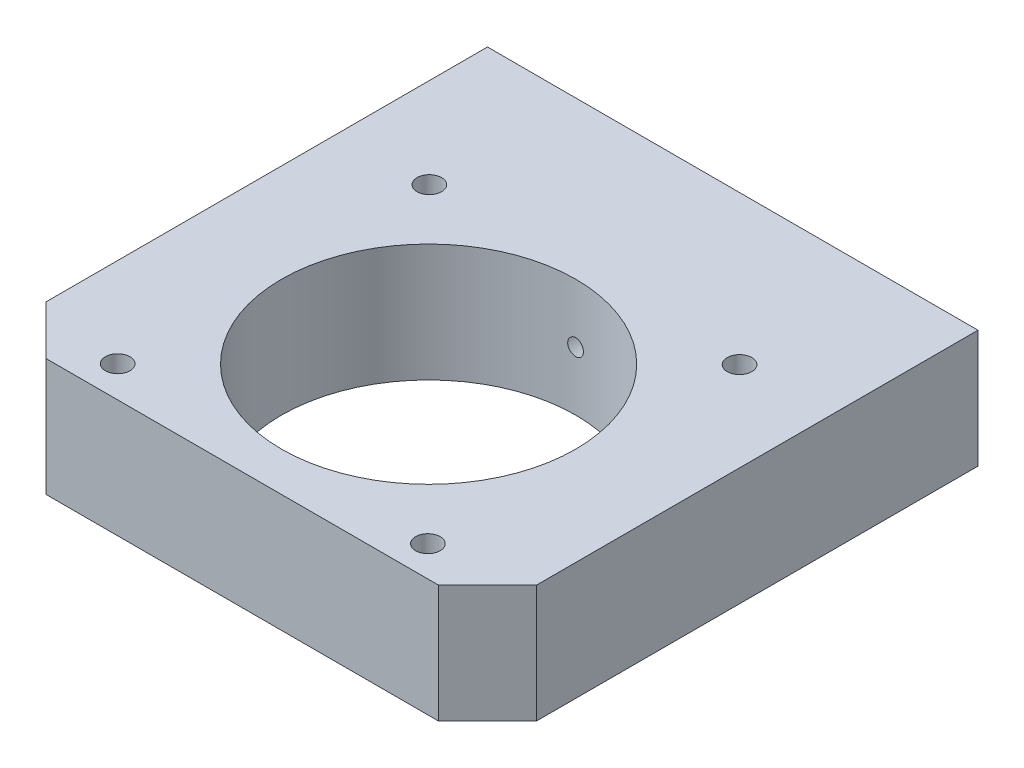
ISO-10303-21;
HEADER;
FILE_DESCRIPTION(('STEP AP214'),'2;1');
FILE_NAME('part.step','',(''),(''),'','','');
FILE_SCHEMA(('AUTOMOTIVE_DESIGN { 1 0 10303 214 1 1 1 1 }'));
ENDSEC;
DATA;
#1=APPLICATION_CONTEXT('core data for automotive mechanical design processes');
#2=APPLICATION_PROTOCOL_DEFINITION('international standard','automotive_design',2000,#1);
#3=PRODUCT_CONTEXT('',#1,'mechanical');
#4=PRODUCT('Part','Part','',(#3));
#5=PRODUCT_RELATED_PRODUCT_CATEGORY('part','',(#4));
#6=PRODUCT_DEFINITION_FORMATION('','',#4);
#7=PRODUCT_DEFINITION_CONTEXT('part definition',#1,'design');
#8=PRODUCT_DEFINITION('design','',#6,#7);
#9=PRODUCT_DEFINITION_SHAPE('','',#8);
#10=(LENGTH_UNIT() NAMED_UNIT(*) SI_UNIT(.MILLI.,.METRE.));
#11=(NAMED_UNIT(*) PLANE_ANGLE_UNIT() SI_UNIT($,.RADIAN.));
#12=(NAMED_UNIT(*) SI_UNIT($,.STERADIAN.) SOLID_ANGLE_UNIT());
#13=UNCERTAINTY_MEASURE_WITH_UNIT(LENGTH_MEASURE(1.E-05),#10,'distance_accuracy_value','');
#14=(GEOMETRIC_REPRESENTATION_CONTEXT(3) GLOBAL_UNCERTAINTY_ASSIGNED_CONTEXT((#13)) GLOBAL_UNIT_ASSIGNED_CONTEXT((#10,
#11,#12)) REPRESENTATION_CONTEXT('',''));
#15=CARTESIAN_POINT('',(0.,0.,0.));
#16=DIRECTION('',(0.,0.,1.));
#17=DIRECTION('',(1.,0.,0.));
#18=AXIS2_PLACEMENT_3D('',#15,#16,#17);
#19=CARTESIAN_POINT('',(26.923076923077,21.6923076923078,50.));
#20=DIRECTION('',(-1.,0.,0.));
#21=DIRECTION('',(0.,0.,1.));
#22=AXIS2_PLACEMENT_3D('',#19,#20,#21);
#23=PLANE('',#22);
#24=DIRECTION('',(0.,0.,-1.));
#25=VECTOR('',#24,1.);
#26=CARTESIAN_POINT('',(26.923076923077,33.6923076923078,50.));
#27=LINE('',#26,#25);
#28=CARTESIAN_POINT('',(26.923076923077,33.6923076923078,45.));
#29=VERTEX_POINT('',#28);
#30=CARTESIAN_POINT('',(26.923076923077,33.6923076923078,0.));
#31=VERTEX_POINT('',#30);
#32=EDGE_CURVE('E333',#29,#31,#27,.T.);
#33=ORIENTED_EDGE('',*,*,#32,.F.);
#34=DIRECTION('',(0.,-1.,0.));
#35=VECTOR('',#34,1.);
#36=CARTESIAN_POINT('',(26.923076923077,21.6923076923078,45.));
#37=LINE('',#36,#35);
#38=CARTESIAN_POINT('',(26.923076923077,21.6923076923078,45.));
#39=VERTEX_POINT('',#38);
#40=EDGE_CURVE('E221',#29,#39,#37,.T.);
#41=ORIENTED_EDGE('',*,*,#40,.T.);
#42=DIRECTION('',(0.,0.,-1.));
#43=VECTOR('',#42,1.);
#44=CARTESIAN_POINT('',(26.923076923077,21.6923076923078,50.));
#45=LINE('',#44,#43);
#46=CARTESIAN_POINT('',(26.923076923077,21.6923076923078,0.));
#47=VERTEX_POINT('',#46);
#48=EDGE_CURVE('E317',#39,#47,#45,.T.);
#49=ORIENTED_EDGE('',*,*,#48,.T.);
#50=DIRECTION('',(0.,1.,0.));
#51=VECTOR('',#50,1.);
#52=CARTESIAN_POINT('',(26.923076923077,21.6923076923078,0.));
#53=LINE('',#52,#51);
#54=EDGE_CURVE('E308',#47,#31,#53,.T.);
#55=ORIENTED_EDGE('',*,*,#54,.T.);
#56=EDGE_LOOP('',(#33,#41,#49,#55));
#57=FACE_BOUND('',#56,.T.);
#58=ADVANCED_FACE('F16',(#57),#23,.F.);
#59=CARTESIAN_POINT('',(26.923076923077,33.6923076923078,50.));
#60=DIRECTION('',(0.,-1.,0.));
#61=DIRECTION('',(0.,0.,-1.));
#62=AXIS2_PLACEMENT_3D('',#59,#60,#61);
#63=PLANE('',#62);
#64=CARTESIAN_POINT('',(-13.8868256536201,33.6923076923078,15.1151368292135));
#65=DIRECTION('',(0.,-1.,0.));
#66=DIRECTION('',(0.,0.,-1.));
#67=AXIS2_PLACEMENT_3D('',#64,#65,#66);
#68=CIRCLE('',#67,1.25);
#69=CARTESIAN_POINT('',(-13.8868256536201,33.6923076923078,13.8651368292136));
#70=VERTEX_POINT('',#69);
#71=EDGE_CURVE('E283',#70,#70,#68,.T.);
#72=ORIENTED_EDGE('',*,*,#71,.T.);
#73=EDGE_LOOP('',(#72));
#74=FACE_BOUND('',#73,.T.);
#75=CARTESIAN_POINT('',(-13.9617862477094,33.6923076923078,46.8099025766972));
#76=DIRECTION('',(0.,-1.,0.));
#77=DIRECTION('',(0.,0.,-1.));
#78=AXIS2_PLACEMENT_3D('',#75,#76,#77);
#79=CIRCLE('',#78,1.25);
#80=CARTESIAN_POINT('',(-13.9617862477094,33.6923076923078,45.5599025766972));
#81=VERTEX_POINT('',#80);
#82=EDGE_CURVE('E289',#81,#81,#79,.T.);
#83=ORIENTED_EDGE('',*,*,#82,.T.);
#84=EDGE_LOOP('',(#83));
#85=FACE_BOUND('',#84,.T.);
#86=CARTESIAN_POINT('',(17.8079400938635,33.6923076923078,15.1900974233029));
#87=DIRECTION('',(0.,-1.,0.));
#88=DIRECTION('',(0.,0.,-1.));
#89=AXIS2_PLACEMENT_3D('',#86,#87,#88);
#90=CIRCLE('',#89,1.25);
#91=CARTESIAN_POINT('',(17.8079400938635,33.6923076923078,13.9400974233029));
#92=VERTEX_POINT('',#91);
#93=EDGE_CURVE('E295',#92,#92,#90,.T.);
#94=ORIENTED_EDGE('',*,*,#93,.T.);
#95=EDGE_LOOP('',(#94));
#96=FACE_BOUND('',#95,.T.);
#97=CARTESIAN_POINT('',(17.7329794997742,33.6923076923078,46.8848631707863));
#98=DIRECTION('',(0.,-1.,0.));
#99=DIRECTION('',(0.,0.,-1.));
#100=AXIS2_PLACEMENT_3D('',#97,#98,#99);
#101=CIRCLE('',#100,1.25);
#102=CARTESIAN_POINT('',(17.7329794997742,33.6923076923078,45.6348631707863));
#103=VERTEX_POINT('',#102);
#104=EDGE_CURVE('E301',#103,#103,#101,.T.);
#105=ORIENTED_EDGE('',*,*,#104,.T.);
#106=EDGE_LOOP('',(#105));
#107=FACE_BOUND('',#106,.T.);
#108=CARTESIAN_POINT('',(1.923076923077,33.6923076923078,31.));
#109=DIRECTION('',(0.,-1.,0.));
#110=DIRECTION('',(0.,0.,-1.));
#111=AXIS2_PLACEMENT_3D('',#108,#109,#110);
#112=CIRCLE('',#111,15.);
#113=CARTESIAN_POINT('',(1.923076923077,33.6923076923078,16.));
#114=VERTEX_POINT('',#113);
#115=EDGE_CURVE('E305',#114,#114,#112,.T.);
#116=ORIENTED_EDGE('',*,*,#115,.T.);
#117=EDGE_LOOP('',(#116));
#118=FACE_BOUND('',#117,.T.);
#119=DIRECTION('',(-1.,0.,0.));
#120=VECTOR('',#119,1.);
#121=CARTESIAN_POINT('',(26.923076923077,33.6923076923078,50.));
#122=LINE('',#121,#120);
#123=CARTESIAN_POINT('',(21.923076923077,33.6923076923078,50.));
#124=VERTEX_POINT('',#123);
#125=CARTESIAN_POINT('',(-18.076923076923,33.6923076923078,50.));
#126=VERTEX_POINT('',#125);
#127=EDGE_CURVE('E311',#124,#126,#122,.T.);
#128=ORIENTED_EDGE('',*,*,#127,.F.);
#129=DIRECTION('',(0.707106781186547,0.,-0.707106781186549));
#130=VECTOR('',#129,1.);
#131=CARTESIAN_POINT('',(21.923076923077,33.6923076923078,50.));
#132=LINE('',#131,#130);
#133=EDGE_CURVE('E341',#124,#29,#132,.T.);
#134=ORIENTED_EDGE('',*,*,#133,.T.);
#135=ORIENTED_EDGE('',*,*,#32,.T.);
#136=DIRECTION('',(-1.,0.,0.));
#137=VECTOR('',#136,1.);
#138=CARTESIAN_POINT('',(26.923076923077,33.6923076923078,0.));
#139=LINE('',#138,#137);
#140=CARTESIAN_POINT('',(-23.076923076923,33.6923076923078,0.));
#141=VERTEX_POINT('',#140);
#142=EDGE_CURVE('E320',#31,#141,#139,.T.);
#143=ORIENTED_EDGE('',*,*,#142,.T.);
#144=DIRECTION('',(0.,0.,-1.));
#145=VECTOR('',#144,1.);
#146=CARTESIAN_POINT('',(-23.076923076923,33.6923076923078,50.));
#147=LINE('',#146,#145);
#148=CARTESIAN_POINT('',(-23.076923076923,33.6923076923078,45.));
#149=VERTEX_POINT('',#148);
#150=EDGE_CURVE('E331',#149,#141,#147,.T.);
#151=ORIENTED_EDGE('',*,*,#150,.F.);
#152=DIRECTION('',(0.707106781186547,0.,0.707106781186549));
#153=VECTOR('',#152,1.);
#154=CARTESIAN_POINT('',(-18.076923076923,33.6923076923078,50.));
#155=LINE('',#154,#153);
#156=EDGE_CURVE('E339',#149,#126,#155,.T.);
#157=ORIENTED_EDGE('',*,*,#156,.T.);
#158=EDGE_LOOP('',(#128,#134,#135,#143,#151,#157));
#159=FACE_BOUND('',#158,.T.);
#160=ADVANCED_FACE('F198',(#74,#85,#96,#107,#118,#159),#63,.F.);
#161=CARTESIAN_POINT('',(-23.076923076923,21.6923076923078,50.));
#162=DIRECTION('',(1.,0.,0.));
#163=DIRECTION('',(0.,0.,-1.));
#164=AXIS2_PLACEMENT_3D('',#161,#162,#163);
#165=PLANE('',#164);
#166=DIRECTION('',(0.,0.,-1.));
#167=VECTOR('',#166,1.);
#168=CARTESIAN_POINT('',(-23.076923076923,21.6923076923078,50.));
#169=LINE('',#168,#167);
#170=CARTESIAN_POINT('',(-23.076923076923,21.6923076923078,45.));
#171=VERTEX_POINT('',#170);
#172=CARTESIAN_POINT('',(-23.076923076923,21.6923076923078,0.));
#173=VERTEX_POINT('',#172);
#174=EDGE_CURVE('E329',#171,#173,#169,.T.);
#175=ORIENTED_EDGE('',*,*,#174,.F.);
#176=DIRECTION('',(0.,1.,0.));
#177=VECTOR('',#176,1.);
#178=CARTESIAN_POINT('',(-23.076923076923,33.6923076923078,45.));
#179=LINE('',#178,#177);
#180=EDGE_CURVE('E228',#171,#149,#179,.T.);
#181=ORIENTED_EDGE('',*,*,#180,.T.);
#182=ORIENTED_EDGE('',*,*,#150,.T.);
#183=DIRECTION('',(0.,-1.,0.));
#184=VECTOR('',#183,1.);
#185=CARTESIAN_POINT('',(-23.076923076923,21.6923076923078,0.));
#186=LINE('',#185,#184);
#187=EDGE_CURVE('E323',#141,#173,#186,.T.);
#188=ORIENTED_EDGE('',*,*,#187,.T.);
#189=EDGE_LOOP('',(#175,#181,#182,#188));
#190=FACE_BOUND('',#189,.T.);
#191=ADVANCED_FACE('F194',(#190),#165,.F.);
#192=CARTESIAN_POINT('',(26.923076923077,21.6923076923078,50.));
#193=DIRECTION('',(0.,1.,0.));
#194=DIRECTION('',(-1.,0.,0.));
#195=AXIS2_PLACEMENT_3D('',#192,#193,#194);
#196=PLANE('',#195);
#197=CARTESIAN_POINT('',(-13.8868256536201,21.6923076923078,15.1151368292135));
#198=DIRECTION('',(0.,-1.,0.));
#199=DIRECTION('',(0.,0.,-1.));
#200=AXIS2_PLACEMENT_3D('',#197,#198,#199);
#201=CIRCLE('',#200,1.25);
#202=CARTESIAN_POINT('',(-13.8868256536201,21.6923076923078,13.8651368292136));
#203=VERTEX_POINT('',#202);
#204=EDGE_CURVE('E267',#203,#203,#201,.T.);
#205=ORIENTED_EDGE('',*,*,#204,.F.);
#206=EDGE_LOOP('',(#205));
#207=FACE_BOUND('',#206,.T.);
#208=CARTESIAN_POINT('',(-13.9617862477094,21.6923076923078,46.8099025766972));
#209=DIRECTION('',(0.,-1.,0.));
#210=DIRECTION('',(0.,0.,-1.));
#211=AXIS2_PLACEMENT_3D('',#208,#209,#210);
#212=CIRCLE('',#211,1.25);
#213=CARTESIAN_POINT('',(-13.9617862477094,21.6923076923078,45.5599025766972));
#214=VERTEX_POINT('',#213);
#215=EDGE_CURVE('E286',#214,#214,#212,.T.);
#216=ORIENTED_EDGE('',*,*,#215,.F.);
#217=EDGE_LOOP('',(#216));
#218=FACE_BOUND('',#217,.T.);
#219=CARTESIAN_POINT('',(17.8079400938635,21.6923076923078,15.1900974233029));
#220=DIRECTION('',(0.,-1.,0.));
#221=DIRECTION('',(0.,0.,-1.));
#222=AXIS2_PLACEMENT_3D('',#219,#220,#221);
#223=CIRCLE('',#222,1.25);
#224=CARTESIAN_POINT('',(17.8079400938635,21.6923076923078,13.9400974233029));
#225=VERTEX_POINT('',#224);
#226=EDGE_CURVE('E292',#225,#225,#223,.T.);
#227=ORIENTED_EDGE('',*,*,#226,.F.);
#228=EDGE_LOOP('',(#227));
#229=FACE_BOUND('',#228,.T.);
#230=CARTESIAN_POINT('',(17.7329794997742,21.6923076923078,46.8848631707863));
#231=DIRECTION('',(0.,-1.,0.));
#232=DIRECTION('',(0.,0.,-1.));
#233=AXIS2_PLACEMENT_3D('',#230,#231,#232);
#234=CIRCLE('',#233,1.25);
#235=CARTESIAN_POINT('',(17.7329794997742,21.6923076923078,45.6348631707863));
#236=VERTEX_POINT('',#235);
#237=EDGE_CURVE('E298',#236,#236,#234,.T.);
#238=ORIENTED_EDGE('',*,*,#237,.F.);
#239=EDGE_LOOP('',(#238));
#240=FACE_BOUND('',#239,.T.);
#241=CARTESIAN_POINT('',(1.923076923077,21.6923076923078,31.));
#242=DIRECTION('',(0.,-1.,0.));
#243=DIRECTION('',(0.,0.,-1.));
#244=AXIS2_PLACEMENT_3D('',#241,#242,#243);
#245=CIRCLE('',#244,15.);
#246=CARTESIAN_POINT('',(1.923076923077,21.6923076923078,16.));
#247=VERTEX_POINT('',#246);
#248=EDGE_CURVE('E304',#247,#247,#245,.T.);
#249=ORIENTED_EDGE('',*,*,#248,.F.);
#250=EDGE_LOOP('',(#249));
#251=FACE_BOUND('',#250,.T.);
#252=ORIENTED_EDGE('',*,*,#48,.F.);
#253=DIRECTION('',(-0.707106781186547,0.,0.707106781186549));
#254=VECTOR('',#253,1.);
#255=CARTESIAN_POINT('',(21.923076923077,21.6923076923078,50.));
#256=LINE('',#255,#254);
#257=CARTESIAN_POINT('',(21.923076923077,21.6923076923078,50.));
#258=VERTEX_POINT('',#257);
#259=EDGE_CURVE('E220',#39,#258,#256,.T.);
#260=ORIENTED_EDGE('',*,*,#259,.T.);
#261=DIRECTION('',(1.,0.,0.));
#262=VECTOR('',#261,1.);
#263=CARTESIAN_POINT('',(26.923076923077,21.6923076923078,50.));
#264=LINE('',#263,#262);
#265=CARTESIAN_POINT('',(-18.076923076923,21.6923076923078,50.));
#266=VERTEX_POINT('',#265);
#267=EDGE_CURVE('E314',#266,#258,#264,.T.);
#268=ORIENTED_EDGE('',*,*,#267,.F.);
#269=DIRECTION('',(-0.707106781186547,0.,-0.707106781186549));
#270=VECTOR('',#269,1.);
#271=CARTESIAN_POINT('',(-18.076923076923,21.6923076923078,50.));
#272=LINE('',#271,#270);
#273=EDGE_CURVE('E229',#266,#171,#272,.T.);
#274=ORIENTED_EDGE('',*,*,#273,.T.);
#275=ORIENTED_EDGE('',*,*,#174,.T.);
#276=DIRECTION('',(1.,0.,0.));
#277=VECTOR('',#276,1.);
#278=CARTESIAN_POINT('',(26.923076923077,21.6923076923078,0.));
#279=LINE('',#278,#277);
#280=EDGE_CURVE('E315',#173,#47,#279,.T.);
#281=ORIENTED_EDGE('',*,*,#280,.T.);
#282=EDGE_LOOP('',(#252,#260,#268,#274,#275,#281));
#283=FACE_BOUND('',#282,.T.);
#284=ADVANCED_FACE('F187',(#207,#218,#229,#240,#251,#283),#196,.F.);
#285=CARTESIAN_POINT('',(0.,0.,50.));
#286=DIRECTION('',(0.,0.,1.));
#287=DIRECTION('',(1.,0.,0.));
#288=AXIS2_PLACEMENT_3D('',#285,#286,#287);
#289=PLANE('',#288);
#290=ORIENTED_EDGE('',*,*,#267,.T.);
#291=DIRECTION('',(0.,1.,0.));
#292=VECTOR('',#291,1.);
#293=CARTESIAN_POINT('',(21.923076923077,33.6923076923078,50.));
#294=LINE('',#293,#292);
#295=EDGE_CURVE('E223',#258,#124,#294,.T.);
#296=ORIENTED_EDGE('',*,*,#295,.T.);
#297=ORIENTED_EDGE('',*,*,#127,.T.);
#298=DIRECTION('',(0.,-1.,0.));
#299=VECTOR('',#298,1.);
#300=CARTESIAN_POINT('',(-18.076923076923,21.6923076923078,50.));
#301=LINE('',#300,#299);
#302=EDGE_CURVE('E335',#126,#266,#301,.T.);
#303=ORIENTED_EDGE('',*,*,#302,.T.);
#304=EDGE_LOOP('',(#290,#296,#297,#303));
#305=FACE_BOUND('',#304,.T.);
#306=ADVANCED_FACE('F184',(#305),#289,.T.);
#307=CARTESIAN_POINT('',(0.,0.,0.));
#308=DIRECTION('',(0.,0.,1.));
#309=DIRECTION('',(1.,0.,0.));
#310=AXIS2_PLACEMENT_3D('',#307,#308,#309);
#311=PLANE('',#310);
#312=CARTESIAN_POINT('',(-13.0769230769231,27.6923076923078,0.));
#313=DIRECTION('',(0.,0.,-1.));
#314=DIRECTION('',(-1.,0.,0.));
#315=AXIS2_PLACEMENT_3D('',#312,#313,#314);
#316=CIRCLE('',#315,2.5);
#317=CARTESIAN_POINT('',(-15.5769230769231,27.6923076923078,0.));
#318=VERTEX_POINT('',#317);
#319=EDGE_CURVE('E561',#318,#318,#316,.T.);
#320=ORIENTED_EDGE('',*,*,#319,.F.);
#321=EDGE_LOOP('',(#320));
#322=FACE_BOUND('',#321,.T.);
#323=CARTESIAN_POINT('',(1.92307692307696,27.6923076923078,0.));
#324=DIRECTION('',(0.,0.,-1.));
#325=DIRECTION('',(-1.,0.,0.));
#326=AXIS2_PLACEMENT_3D('',#323,#324,#325);
#327=CIRCLE('',#326,2.5);
#328=CARTESIAN_POINT('',(-0.576923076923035,27.6923076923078,0.));
#329=VERTEX_POINT('',#328);
#330=EDGE_CURVE('E113',#329,#329,#327,.T.);
#331=ORIENTED_EDGE('',*,*,#330,.F.);
#332=EDGE_LOOP('',(#331));
#333=FACE_BOUND('',#332,.T.);
#334=CARTESIAN_POINT('',(16.9230769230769,27.6923076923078,0.));
#335=DIRECTION('',(0.,0.,-1.));
#336=DIRECTION('',(-1.,0.,0.));
#337=AXIS2_PLACEMENT_3D('',#334,#335,#336);
#338=CIRCLE('',#337,2.5);
#339=CARTESIAN_POINT('',(14.4230769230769,27.6923076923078,0.));
#340=VERTEX_POINT('',#339);
#341=EDGE_CURVE('E168',#340,#340,#338,.T.);
#342=ORIENTED_EDGE('',*,*,#341,.F.);
#343=EDGE_LOOP('',(#342));
#344=FACE_BOUND('',#343,.T.);
#345=ORIENTED_EDGE('',*,*,#54,.F.);
#346=ORIENTED_EDGE('',*,*,#280,.F.);
#347=ORIENTED_EDGE('',*,*,#187,.F.);
#348=ORIENTED_EDGE('',*,*,#142,.F.);
#349=EDGE_LOOP('',(#345,#346,#347,#348));
#350=FACE_BOUND('',#349,.T.);
#351=ADVANCED_FACE('F182',(#322,#333,#344,#350),#311,.F.);
#352=CARTESIAN_POINT('',(1.923076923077,33.6923076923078,31.));
#353=DIRECTION('',(0.,-1.,0.));
#354=DIRECTION('',(0.,0.,-1.));
#355=AXIS2_PLACEMENT_3D('',#352,#353,#354);
#356=CYLINDRICAL_SURFACE('',#355,15.);
#357=CARTESIAN_POINT('',(1.23497310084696,27.2660384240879,16.0157912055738));
#358=CARTESIAN_POINT('',(1.211246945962,27.307785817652,16.0168806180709));
#359=CARTESIAN_POINT('',(1.19106479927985,27.3515959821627,16.0178631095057));
#360=CARTESIAN_POINT('',(1.15828292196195,27.4420197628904,16.0195006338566));
#361=CARTESIAN_POINT('',(1.14569498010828,27.4886376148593,16.0201551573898));
#362=CARTESIAN_POINT('',(1.12839188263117,27.5833931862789,16.021063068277));
#363=CARTESIAN_POINT('',(1.12368883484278,27.631533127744,16.0213158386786));
#364=CARTESIAN_POINT('',(1.12229669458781,27.7279131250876,16.0213902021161));
#365=CARTESIAN_POINT('',(1.12560536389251,27.7761531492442,16.0212119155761));
#366=CARTESIAN_POINT('',(1.14026703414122,27.8721088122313,16.0204384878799));
#367=CARTESIAN_POINT('',(1.15173526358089,27.919806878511,16.0198373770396));
#368=CARTESIAN_POINT('',(1.18259021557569,28.0125727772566,16.0182805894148));
#369=CARTESIAN_POINT('',(1.20197748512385,28.0576404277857,16.0173248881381));
#370=CARTESIAN_POINT('',(1.24797811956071,28.1433203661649,16.0151822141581));
#371=CARTESIAN_POINT('',(1.27451429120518,28.1839740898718,16.0139977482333));
#372=CARTESIAN_POINT('',(1.3342500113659,28.2600529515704,16.0115319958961));
#373=CARTESIAN_POINT('',(1.3674484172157,28.2954789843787,16.0102507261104));
#374=CARTESIAN_POINT('',(1.43843639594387,28.358816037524,16.0077906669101));
#375=CARTESIAN_POINT('',(1.47604013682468,28.3869350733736,16.006609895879));
#376=CARTESIAN_POINT('',(1.55561324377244,28.4361228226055,16.0044489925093));
#377=CARTESIAN_POINT('',(1.59758135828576,28.457193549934,16.0034688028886));
#378=CARTESIAN_POINT('',(1.68272512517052,28.4907271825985,16.0018679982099));
#379=CARTESIAN_POINT('',(1.72576882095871,28.5035246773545,16.0012335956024));
#380=CARTESIAN_POINT('',(1.81342727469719,28.5214448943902,16.0003368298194));
#381=CARTESIAN_POINT('',(1.85804167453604,28.5265693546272,16.000074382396));
#382=CARTESIAN_POINT('',(1.9460094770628,28.5289082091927,15.9999551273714));
#383=CARTESIAN_POINT('',(1.98935632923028,28.5263761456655,16.0000853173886));
#384=CARTESIAN_POINT('',(2.07499731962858,28.5140444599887,16.0007082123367));
#385=CARTESIAN_POINT('',(2.1172915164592,28.5042452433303,16.0012008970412));
#386=CARTESIAN_POINT('',(2.19947823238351,28.4777854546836,16.002490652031));
#387=CARTESIAN_POINT('',(2.2393796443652,28.4611523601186,16.003286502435));
#388=CARTESIAN_POINT('',(2.31591900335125,28.4215908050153,16.0050961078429));
#389=CARTESIAN_POINT('',(2.35255662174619,28.3986617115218,16.0061098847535));
#390=CARTESIAN_POINT('',(2.42256872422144,28.3465645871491,16.0082766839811));
#391=CARTESIAN_POINT('',(2.45583444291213,28.3172506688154,16.0094326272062));
#392=CARTESIAN_POINT('',(2.51721176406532,28.2536525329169,16.0117396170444));
#393=CARTESIAN_POINT('',(2.54532240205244,28.2193673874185,16.012890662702));
#394=CARTESIAN_POINT('',(2.59682444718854,28.1452888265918,16.0151156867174));
#395=CARTESIAN_POINT('',(2.61997295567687,28.1053263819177,16.0161845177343));
#396=CARTESIAN_POINT('',(2.65952020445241,28.0221862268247,16.0180760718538));
#397=CARTESIAN_POINT('',(2.67591762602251,27.979007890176,16.0188987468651));
#398=CARTESIAN_POINT('',(2.70211392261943,27.8889051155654,16.0202375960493));
#399=CARTESIAN_POINT('',(2.71163880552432,27.8419007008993,16.0207409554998));
#400=CARTESIAN_POINT('',(2.72285084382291,27.7469618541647,16.0213353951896));
#401=CARTESIAN_POINT('',(2.72453690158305,27.6990272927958,16.0214264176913));
#402=CARTESIAN_POINT('',(2.71998697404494,27.6025353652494,16.0211836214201));
#403=CARTESIAN_POINT('',(2.71358600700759,27.5539856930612,16.02084095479));
#404=CARTESIAN_POINT('',(2.69271582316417,27.4586522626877,16.0197542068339));
#405=CARTESIAN_POINT('',(2.6782462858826,27.4118685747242,16.0190101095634));
#406=CARTESIAN_POINT('',(2.64161323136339,27.3215648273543,16.0172085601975));
#407=CARTESIAN_POINT('',(2.61947067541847,27.2780362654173,16.0161519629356));
#408=CARTESIAN_POINT('',(2.56800572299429,27.1954518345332,16.0138488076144));
#409=CARTESIAN_POINT('',(2.53868413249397,27.1563954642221,16.0126022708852));
#410=CARTESIAN_POINT('',(2.47447366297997,27.0850151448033,16.0101046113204));
#411=CARTESIAN_POINT('',(2.43975243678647,27.0525405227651,16.0088544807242));
#412=CARTESIAN_POINT('',(2.36514063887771,26.9941914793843,16.0064691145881));
#413=CARTESIAN_POINT('',(2.32525141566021,26.9683153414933,16.0053338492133));
#414=CARTESIAN_POINT('',(2.24323779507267,26.9250681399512,16.0033634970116));
#415=CARTESIAN_POINT('',(2.2012784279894,26.9073846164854,16.0025177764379));
#416=CARTESIAN_POINT('',(2.11490926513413,26.8796282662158,16.00116464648));
#417=CARTESIAN_POINT('',(2.07050011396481,26.8695534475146,16.0006571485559));
#418=CARTESIAN_POINT('',(1.98233565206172,26.8576418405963,16.000054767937));
#419=CARTESIAN_POINT('',(1.9386211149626,26.8555024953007,15.9999447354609));
#420=CARTESIAN_POINT('',(1.85147191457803,26.8586994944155,16.0001076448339));
#421=CARTESIAN_POINT('',(1.80803720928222,26.8640346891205,16.0003805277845));
#422=CARTESIAN_POINT('',(1.7233092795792,26.8818525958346,16.0012712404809));
#423=CARTESIAN_POINT('',(1.68199451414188,26.8942336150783,16.0018841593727));
#424=CARTESIAN_POINT('',(1.6019683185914,26.9256376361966,16.0033839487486));
#425=CARTESIAN_POINT('',(1.56325768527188,26.9446626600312,16.0042709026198));
#426=CARTESIAN_POINT('',(1.48877578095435,26.9891220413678,16.0062413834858));
#427=CARTESIAN_POINT('',(1.453069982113,27.0146656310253,16.0073281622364));
#428=CARTESIAN_POINT('',(1.38628643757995,27.0711622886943,16.0095706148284));
#429=CARTESIAN_POINT('',(1.35520414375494,27.1021099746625,16.0107262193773));
#430=CARTESIAN_POINT('',(1.3094271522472,27.155551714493,16.0125473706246));
#431=CARTESIAN_POINT('',(1.29306503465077,27.1766432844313,16.0132284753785));
#432=CARTESIAN_POINT('',(1.26242841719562,27.2202905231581,16.0145477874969));
#433=CARTESIAN_POINT('',(1.24815387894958,27.2428461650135,16.0151859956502));
#434=CARTESIAN_POINT('',(1.23497310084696,27.2660384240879,16.0157912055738));
#435=B_SPLINE_CURVE_WITH_KNOTS('',3,(#357,#358,#359,#360,#361,#362,#363,#364,#365,#366,#367,
#368,#369,#370,#371,#372,#373,#374,#375,#376,#377,#378,#379,#380,#381,#382,#383,#384,#385,#386,
#387,#388,#389,#390,#391,#392,#393,#394,#395,#396,#397,#398,#399,#400,#401,#402,#403,#404,#405,
#406,#407,#408,#409,#410,#411,#412,#413,#414,#415,#416,#417,#418,#419,#420,#421,#422,#423,#424,
#425,#426,#427,#428,#429,#430,#431,#432,#433,#434),.UNSPECIFIED.,.T.,.F.,(4,2,2,2,2,2,2,2,2,2,2,
2,2,2,2,2,2,2,2,2,2,2,2,2,2,2,2,2,2,2,2,2,2,2,2,2,2,2,4),(0.,0.143994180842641,
0.288211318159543,0.432649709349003,0.577047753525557,0.723526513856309,0.87001539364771,
1.01498184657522,1.1599234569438,1.30012114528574,1.44027873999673,1.57433906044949,
1.70836901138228,1.83800976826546,1.96764329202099,2.09676061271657,2.22589091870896,
2.35835752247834,2.49084888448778,2.62881301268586,2.76680407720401,2.91003122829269,
3.05327843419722,3.1994957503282,3.34571887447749,3.49154565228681,3.63735606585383,
3.77931215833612,3.9212312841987,4.05716979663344,4.1930727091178,4.32373741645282,
4.45438202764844,4.58318719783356,4.7120316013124,4.84319584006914,4.97423018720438,
5.05422588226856,5.13422010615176),.UNSPECIFIED.);
#436=CARTESIAN_POINT('',(1.23497310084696,27.2660384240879,16.0157912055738));
#437=VERTEX_POINT('',#436);
#438=EDGE_CURVE('E161',#437,#437,#435,.T.);
#439=ORIENTED_EDGE('',*,*,#438,.T.);
#440=EDGE_LOOP('',(#439));
#441=FACE_BOUND('',#440,.T.);
#442=ORIENTED_EDGE('',*,*,#115,.F.);
#443=EDGE_LOOP('',(#442));
#444=FACE_BOUND('',#443,.T.);
#445=ORIENTED_EDGE('',*,*,#248,.T.);
#446=EDGE_LOOP('',(#445));
#447=FACE_BOUND('',#446,.T.);
#448=ADVANCED_FACE('F176',(#441,#444,#447),#356,.F.);
#449=CARTESIAN_POINT('',(17.7329794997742,21.6923076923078,46.8848631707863));
#450=DIRECTION('',(0.,-1.,0.));
#451=DIRECTION('',(0.,0.,-1.));
#452=AXIS2_PLACEMENT_3D('',#449,#450,#451);
#453=CYLINDRICAL_SURFACE('',#452,1.25);
#454=ORIENTED_EDGE('',*,*,#104,.F.);
#455=EDGE_LOOP('',(#454));
#456=FACE_BOUND('',#455,.T.);
#457=ORIENTED_EDGE('',*,*,#237,.T.);
#458=EDGE_LOOP('',(#457));
#459=FACE_BOUND('',#458,.T.);
#460=ADVANCED_FACE('F181',(#456,#459),#453,.F.);
#461=CARTESIAN_POINT('',(17.8079400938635,21.6923076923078,15.1900974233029));
#462=DIRECTION('',(0.,-1.,0.));
#463=DIRECTION('',(0.,0.,-1.));
#464=AXIS2_PLACEMENT_3D('',#461,#462,#463);
#465=CYLINDRICAL_SURFACE('',#464,1.25);
#466=CARTESIAN_POINT('',(16.5724794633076,30.1676019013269,15.));
#467=CARTESIAN_POINT('',(16.5778242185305,30.1683548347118,14.9652650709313));
#468=CARTESIAN_POINT('',(16.5846309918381,30.1693057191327,14.930777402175));
#469=CARTESIAN_POINT('',(16.6011177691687,30.1715042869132,14.8625092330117));
#470=CARTESIAN_POINT('',(16.6107974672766,30.1727519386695,14.8287286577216));
#471=CARTESIAN_POINT('',(16.6440501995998,30.1767891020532,14.7288207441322));
#472=CARTESIAN_POINT('',(16.6718475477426,30.1798746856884,14.6640583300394));
#473=CARTESIAN_POINT('',(16.7379164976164,30.1856606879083,14.5401043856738));
#474=CARTESIAN_POINT('',(16.7761923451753,30.1883609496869,14.4809151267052));
#475=CARTESIAN_POINT('',(16.8621673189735,30.1919347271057,14.3697658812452));
#476=CARTESIAN_POINT('',(16.9098632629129,30.1928088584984,14.3178034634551));
#477=CARTESIAN_POINT('',(17.0127889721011,30.1912213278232,14.2231035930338));
#478=CARTESIAN_POINT('',(17.0679412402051,30.188791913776,14.180281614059));
#479=CARTESIAN_POINT('',(17.1843196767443,30.1793038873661,14.1045510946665));
#480=CARTESIAN_POINT('',(17.245543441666,30.172247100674,14.0716386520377));
#481=CARTESIAN_POINT('',(17.3684613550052,30.1530581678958,14.0180848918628));
#482=CARTESIAN_POINT('',(17.4299578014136,30.1412155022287,13.996884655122));
#483=CARTESIAN_POINT('',(17.5542691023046,30.112156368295,13.9644232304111));
#484=CARTESIAN_POINT('',(17.6170837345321,30.0949407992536,13.9531603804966));
#485=CARTESIAN_POINT('',(17.7410371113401,30.0555907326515,13.9403577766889));
#486=CARTESIAN_POINT('',(17.8021867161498,30.0335371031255,13.9386691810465));
#487=CARTESIAN_POINT('',(17.9222572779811,29.9848700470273,13.9438839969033));
#488=CARTESIAN_POINT('',(17.9811770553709,29.9582542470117,13.9507918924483));
#489=CARTESIAN_POINT('',(18.1010973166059,29.8984749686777,13.9732865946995));
#490=CARTESIAN_POINT('',(18.1617612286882,29.8649292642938,13.9896375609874));
#491=CARTESIAN_POINT('',(18.2781051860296,29.7943387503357,14.0302508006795));
#492=CARTESIAN_POINT('',(18.3337867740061,29.757295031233,14.0545106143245));
#493=CARTESIAN_POINT('',(18.4497668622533,29.6735326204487,14.1151035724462));
#494=CARTESIAN_POINT('',(18.5089564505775,29.6263066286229,14.1528506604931));
#495=CARTESIAN_POINT('',(18.6196783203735,29.5299554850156,14.2369739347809));
#496=CARTESIAN_POINT('',(18.6711743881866,29.4808226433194,14.2833887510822));
#497=CARTESIAN_POINT('',(18.7471574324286,29.4024022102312,14.3641989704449));
#498=CARTESIAN_POINT('',(18.7742525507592,29.3729773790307,14.3960538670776));
#499=CARTESIAN_POINT('',(18.8254212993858,29.3148315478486,14.4627722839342));
#500=CARTESIAN_POINT('',(18.8494928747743,29.2861110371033,14.4976378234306));
#501=CARTESIAN_POINT('',(18.8942246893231,29.2304362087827,14.5701896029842));
#502=CARTESIAN_POINT('',(18.9149142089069,29.2034681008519,14.6078470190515));
#503=CARTESIAN_POINT('',(18.9528318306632,29.1521397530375,14.6864840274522));
#504=CARTESIAN_POINT('',(18.9700651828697,29.1277755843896,14.7274584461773));
#505=CARTESIAN_POINT('',(18.998032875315,29.0869628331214,14.8059008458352));
#506=CARTESIAN_POINT('',(19.009372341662,29.0698719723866,14.8428059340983));
#507=CARTESIAN_POINT('',(19.0289198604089,29.0398078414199,14.9193920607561));
#508=CARTESIAN_POINT('',(19.0371007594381,29.0268704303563,14.9590938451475));
#509=CARTESIAN_POINT('',(19.0434007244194,29.0167800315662,15.));
#510=B_SPLINE_CURVE_WITH_KNOTS('',3,(#466,#467,#468,#469,#470,#471,#472,#473,#474,#475,#476,
#477,#478,#479,#480,#481,#482,#483,#484,#485,#486,#487,#488,#489,#490,#491,#492,#493,#494,#495,
#496,#497,#498,#499,#500,#501,#502,#503,#504,#505,#506,#507,#508,#509),.UNSPECIFIED.,.F.,.F.,(4,
2,2,2,2,2,2,2,2,2,2,2,2,2,2,2,2,2,2,2,2,4),(0.,0.105388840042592,0.210766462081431,
0.421315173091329,0.631949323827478,0.842512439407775,1.05103480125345,1.25947494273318,
1.45684399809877,1.65418003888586,1.84843969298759,2.04280071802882,2.25567900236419,
2.46849114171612,2.72142756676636,2.97551940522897,3.1287693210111,3.28212283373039,
3.43406892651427,3.58578243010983,3.71207453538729,3.83942937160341),.UNSPECIFIED.);
#511=CARTESIAN_POINT('',(16.5724794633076,30.1676019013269,15.));
#512=VERTEX_POINT('',#511);
#513=CARTESIAN_POINT('',(19.0434007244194,29.0167800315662,15.));
#514=VERTEX_POINT('',#513);
#515=EDGE_CURVE('E272',#512,#514,#510,.T.);
#516=ORIENTED_EDGE('',*,*,#515,.T.);
#517=CARTESIAN_POINT('',(19.0124062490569,29.4649701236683,14.8557902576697));
#518=CARTESIAN_POINT('',(19.0187234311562,29.3989978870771,14.8785319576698));
#519=CARTESIAN_POINT('',(19.0242044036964,29.3327809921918,14.9007969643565));
#520=CARTESIAN_POINT('',(19.0336876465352,29.1998182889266,14.9440680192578));
#521=CARTESIAN_POINT('',(19.0376896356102,29.133072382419,14.9650738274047));
#522=CARTESIAN_POINT('',(19.0444260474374,28.9986445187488,15.0056304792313));
#523=CARTESIAN_POINT('',(19.047152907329,28.9309593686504,15.0251720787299));
#524=CARTESIAN_POINT('',(19.0515267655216,28.7950214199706,15.0622656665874));
#525=CARTESIAN_POINT('',(19.0531738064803,28.7267686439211,15.0798177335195));
#526=CARTESIAN_POINT('',(19.0568141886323,28.5239648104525,15.1281226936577));
#527=CARTESIAN_POINT('',(19.0576289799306,28.3885103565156,15.1554226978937));
#528=CARTESIAN_POINT('',(19.057977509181,28.1840008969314,15.186386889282));
#529=CARTESIAN_POINT('',(19.0579486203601,28.1156907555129,15.19503965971));
#530=CARTESIAN_POINT('',(19.0578215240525,27.9787058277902,15.2086117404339));
#531=CARTESIAN_POINT('',(19.0577233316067,27.9100311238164,15.2135318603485));
#532=CARTESIAN_POINT('',(19.0575999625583,27.7707908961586,15.2194287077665));
#533=CARTESIAN_POINT('',(19.0575766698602,27.7002209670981,15.2203039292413));
#534=CARTESIAN_POINT('',(19.0576330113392,27.559161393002,15.2177881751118));
#535=CARTESIAN_POINT('',(19.0577126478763,27.4886717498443,15.2143971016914));
#536=CARTESIAN_POINT('',(19.0579681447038,27.2774980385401,15.1980770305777));
#537=CARTESIAN_POINT('',(19.0581604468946,27.1372722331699,15.1789948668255));
#538=CARTESIAN_POINT('',(19.0566543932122,26.8591841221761,15.1282235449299));
#539=CARTESIAN_POINT('',(19.0549545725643,26.7213237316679,15.0965246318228));
#540=CARTESIAN_POINT('',(19.0474758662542,26.4480339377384,15.0246956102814));
#541=CARTESIAN_POINT('',(19.0416989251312,26.3126034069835,14.9845695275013));
#542=CARTESIAN_POINT('',(19.0302166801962,26.1348807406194,14.9279117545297));
#543=CARTESIAN_POINT('',(19.0271118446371,26.0916199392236,14.9138024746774));
#544=CARTESIAN_POINT('',(19.0202558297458,26.0054207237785,14.8851277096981));
#545=CARTESIAN_POINT('',(19.0165062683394,25.96248177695,14.870563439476));
#546=CARTESIAN_POINT('',(19.0124062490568,25.9196452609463,14.8557902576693));
#547=B_SPLINE_CURVE_WITH_KNOTS('',3,(#517,#518,#519,#520,#521,#522,#523,#524,#525,#526,#527,
#528,#529,#530,#531,#532,#533,#534,#535,#536,#537,#538,#539,#540,#541,#542,#543,#544,#545,#546),
.UNSPECIFIED.,.F.,.F.,(4,2,2,2,2,2,2,2,2,2,2,2,2,2,4),(0.,0.210194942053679,0.420429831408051,
0.631896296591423,0.843354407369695,1.25729231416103,1.46377698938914,1.67021686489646,
1.88181015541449,2.09340829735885,2.51709085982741,2.94110164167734,3.36491033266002,
3.50173344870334,3.63821809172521),.UNSPECIFIED.);
#548=CARTESIAN_POINT('',(19.0434007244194,26.3678353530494,15.));
#549=VERTEX_POINT('',#548);
#550=EDGE_CURVE('E123',#514,#549,#547,.T.);
#551=ORIENTED_EDGE('',*,*,#550,.T.);
#552=CARTESIAN_POINT('',(19.0434007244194,26.3678353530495,15.));
#553=CARTESIAN_POINT('',(19.0384129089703,26.3598531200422,14.9675805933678));
#554=CARTESIAN_POINT('',(19.0322320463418,26.3500553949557,14.9358942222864));
#555=CARTESIAN_POINT('',(19.0177766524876,26.3276051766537,14.8741967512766));
#556=CARTESIAN_POINT('',(19.0095113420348,26.3149652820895,14.8441789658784));
#557=CARTESIAN_POINT('',(18.9821698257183,26.2741453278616,14.7572529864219));
#558=CARTESIAN_POINT('',(18.9604111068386,26.2428309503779,14.7026676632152));
#559=CARTESIAN_POINT('',(18.9183793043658,26.1857762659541,14.614734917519));
#560=CARTESIAN_POINT('',(18.8995818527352,26.1611398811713,14.5798923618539));
#561=CARTESIAN_POINT('',(18.8592996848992,26.1105087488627,14.5128456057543));
#562=CARTESIAN_POINT('',(18.8378148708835,26.0845139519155,14.4806415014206));
#563=CARTESIAN_POINT('',(18.7692186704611,26.00510370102,14.3873230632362));
#564=CARTESIAN_POINT('',(18.7181942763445,25.9505856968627,14.3299688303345));
#565=CARTESIAN_POINT('',(18.6043681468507,25.840341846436,14.2234140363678));
#566=CARTESIAN_POINT('',(18.5412244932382,25.7846380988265,14.1745576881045));
#567=CARTESIAN_POINT('',(18.4048104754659,25.6768742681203,14.0888734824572));
#568=CARTESIAN_POINT('',(18.3315782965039,25.6248015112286,14.052001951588));
#569=CARTESIAN_POINT('',(18.192444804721,25.537326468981,13.99890175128));
#570=CARTESIAN_POINT('',(18.1283324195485,25.5007423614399,13.9799432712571));
#571=CARTESIAN_POINT('',(17.9952703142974,25.4326679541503,13.9523508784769));
#572=CARTESIAN_POINT('',(17.9263209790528,25.4011772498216,13.9437161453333));
#573=CARTESIAN_POINT('',(17.7848349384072,25.3442822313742,13.9382948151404));
#574=CARTESIAN_POINT('',(17.7122753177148,25.3189250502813,13.9415970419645));
#575=CARTESIAN_POINT('',(17.566795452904,25.2754138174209,13.9613898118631));
#576=CARTESIAN_POINT('',(17.4938755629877,25.2572537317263,13.9778692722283));
#577=CARTESIAN_POINT('',(17.3599466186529,25.2299456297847,14.0212849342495));
#578=CARTESIAN_POINT('',(17.2985933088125,25.219951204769,14.0466445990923));
#579=CARTESIAN_POINT('',(17.1802381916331,25.2048538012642,14.1070911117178));
#580=CARTESIAN_POINT('',(17.1232359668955,25.1997503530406,14.1421770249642));
#581=CARTESIAN_POINT('',(17.0171327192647,25.1935285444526,14.2198825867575));
#582=CARTESIAN_POINT('',(16.9678411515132,25.1922912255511,14.2622341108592));
#583=CARTESIAN_POINT('',(16.876404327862,25.1923245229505,14.3540700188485));
#584=CARTESIAN_POINT('',(16.8342620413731,25.1935961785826,14.4035573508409));
#585=CARTESIAN_POINT('',(16.7562130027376,25.1975602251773,14.5111186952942));
#586=CARTESIAN_POINT('',(16.7207387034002,25.2003223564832,14.5695035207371));
#587=CARTESIAN_POINT('',(16.659787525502,25.2060211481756,14.691230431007));
#588=CARTESIAN_POINT('',(16.6343007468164,25.2089576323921,14.7545675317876));
#589=CARTESIAN_POINT('',(16.6049676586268,25.2126123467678,14.8490438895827));
#590=CARTESIAN_POINT('',(16.5968982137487,25.2136672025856,14.8789140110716));
#591=CARTESIAN_POINT('',(16.5830053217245,25.2155359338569,14.9391262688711));
#592=CARTESIAN_POINT('',(16.5771781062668,25.216350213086,14.9694675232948));
#593=CARTESIAN_POINT('',(16.5724794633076,25.2170134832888,15.));
#594=B_SPLINE_CURVE_WITH_KNOTS('',3,(#552,#553,#554,#555,#556,#557,#558,#559,#560,#561,#562,
#563,#564,#565,#566,#567,#568,#569,#570,#571,#572,#573,#574,#575,#576,#577,#578,#579,#580,#581,
#582,#583,#584,#585,#586,#587,#588,#589,#590,#591,#592,#593),.UNSPECIFIED.,.F.,.F.,(4,2,2,2,2,2,
2,2,2,2,2,2,2,2,2,2,2,2,2,2,4),(0.,0.101048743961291,0.201658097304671,0.400378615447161,
0.540121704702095,0.679869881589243,0.961180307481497,1.25207130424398,1.5418900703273,
1.76963946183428,1.99737075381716,2.22680008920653,2.45603666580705,2.65643087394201,
2.85680583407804,3.05095140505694,3.2451774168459,3.44939781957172,3.65341527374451,
3.74621963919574,3.83886734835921),.UNSPECIFIED.);
#595=CARTESIAN_POINT('',(16.5724794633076,25.2170134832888,15.));
#596=VERTEX_POINT('',#595);
#597=EDGE_CURVE('E242',#549,#596,#594,.T.);
#598=ORIENTED_EDGE('',*,*,#597,.T.);
#599=CARTESIAN_POINT('',(16.6034739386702,24.9710059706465,14.8557902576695));
#600=CARTESIAN_POINT('',(16.5944795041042,25.0264187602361,14.8882272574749));
#601=CARTESIAN_POINT('',(16.5868484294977,25.0819839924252,14.9207741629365));
#602=CARTESIAN_POINT('',(16.5742545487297,25.1933007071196,14.98606156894));
#603=CARTESIAN_POINT('',(16.5692916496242,25.2490521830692,15.0188020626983));
#604=CARTESIAN_POINT('',(16.5619653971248,25.3607738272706,15.0845393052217));
#605=CARTESIAN_POINT('',(16.5596089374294,25.4167441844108,15.1175365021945));
#606=CARTESIAN_POINT('',(16.5575190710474,25.5286433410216,15.1836802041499));
#607=CARTESIAN_POINT('',(16.5577857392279,25.5845721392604,15.216826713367));
#608=CARTESIAN_POINT('',(16.5626158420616,25.7539922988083,15.3175682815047));
#609=CARTESIAN_POINT('',(16.5713331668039,25.867266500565,15.3853794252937));
#610=CARTESIAN_POINT('',(16.6006065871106,26.0919904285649,15.521270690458));
#611=CARTESIAN_POINT('',(16.6211475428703,26.2034423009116,15.5893503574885));
#612=CARTESIAN_POINT('',(16.6614302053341,26.3650327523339,15.6892961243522));
#613=CARTESIAN_POINT('',(16.6758558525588,26.416442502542,15.7212836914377));
#614=CARTESIAN_POINT('',(16.7080210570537,26.5183467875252,15.7850378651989));
#615=CARTESIAN_POINT('',(16.7257597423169,26.5688415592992,15.8168045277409));
#616=CARTESIAN_POINT('',(16.7647540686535,26.6685772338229,15.8797556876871));
#617=CARTESIAN_POINT('',(16.7859980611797,26.7178216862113,15.9109417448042));
#618=CARTESIAN_POINT('',(16.8322175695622,26.8151140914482,15.9723619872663));
#619=CARTESIAN_POINT('',(16.8571915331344,26.8631625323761,16.0025965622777));
#620=CARTESIAN_POINT('',(16.9046013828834,26.9475048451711,16.0546320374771));
#621=CARTESIAN_POINT('',(16.926321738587,26.9839856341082,16.0767865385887));
#622=CARTESIAN_POINT('',(16.9714853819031,27.056873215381,16.1195098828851));
#623=CARTESIAN_POINT('',(16.9949303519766,27.0932798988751,16.1400771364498));
#624=CARTESIAN_POINT('',(17.042492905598,27.1667379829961,16.1787960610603));
#625=CARTESIAN_POINT('',(17.0666080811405,27.2037869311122,16.1969552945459));
#626=CARTESIAN_POINT('',(17.1137340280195,27.279948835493,16.2300005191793));
#627=CARTESIAN_POINT('',(17.1367472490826,27.3190567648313,16.2448940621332));
#628=CARTESIAN_POINT('',(17.1736072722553,27.3908342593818,16.2673501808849));
#629=CARTESIAN_POINT('',(17.1883219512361,27.4227549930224,16.2758147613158));
#630=CARTESIAN_POINT('',(17.2136792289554,27.4887467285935,16.2899001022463));
#631=CARTESIAN_POINT('',(17.2243332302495,27.5228113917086,16.2955288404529));
#632=CARTESIAN_POINT('',(17.238821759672,27.5874237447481,16.3030495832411));
#633=CARTESIAN_POINT('',(17.2434342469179,27.6177421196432,16.3053724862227));
#634=CARTESIAN_POINT('',(17.247949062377,27.6788572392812,16.3076472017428));
#635=CARTESIAN_POINT('',(17.2478474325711,27.7096543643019,16.3075970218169));
#636=CARTESIAN_POINT('',(17.242938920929,27.7707155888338,16.3051219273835));
#637=CARTESIAN_POINT('',(17.2381387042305,27.8009803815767,16.3027003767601));
#638=CARTESIAN_POINT('',(17.224496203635,27.8602348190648,16.2956074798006));
#639=CARTESIAN_POINT('',(17.215658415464,27.8892258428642,16.290938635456));
#640=CARTESIAN_POINT('',(17.1877104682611,27.9653165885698,16.2755479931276));
#641=CARTESIAN_POINT('',(17.1657347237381,28.0109454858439,16.2628756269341));
#642=CARTESIAN_POINT('',(17.1298628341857,28.076542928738,16.2402972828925));
#643=CARTESIAN_POINT('',(17.1173647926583,28.098014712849,16.2321362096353));
#644=CARTESIAN_POINT('',(17.0918663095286,28.1402423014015,16.2147802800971));
#645=CARTESIAN_POINT('',(17.0788658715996,28.1609981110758,16.2055854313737));
#646=CARTESIAN_POINT('',(17.0441129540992,28.2156050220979,16.179941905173));
#647=CARTESIAN_POINT('',(17.0222654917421,28.2490265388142,16.1627216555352));
#648=CARTESIAN_POINT('',(16.9794300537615,28.3154652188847,16.1265064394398));
#649=CARTESIAN_POINT('',(16.9584423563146,28.348482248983,16.1075109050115));
#650=CARTESIAN_POINT('',(16.9179329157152,28.4146974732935,16.0682681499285));
#651=CARTESIAN_POINT('',(16.898411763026,28.4478957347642,16.0480204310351));
#652=CARTESIAN_POINT('',(16.861123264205,28.5147415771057,16.0066840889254));
#653=CARTESIAN_POINT('',(16.8433557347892,28.5483891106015,15.9855955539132));
#654=CARTESIAN_POINT('',(16.7928836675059,28.650054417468,15.921608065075));
#655=CARTESIAN_POINT('',(16.7629183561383,28.7189407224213,15.8778970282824));
#656=CARTESIAN_POINT('',(16.7099010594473,28.8588521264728,15.7896557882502));
#657=CARTESIAN_POINT('',(16.6868548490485,28.9298789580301,15.7451249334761));
#658=CARTESIAN_POINT('',(16.6391056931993,29.1015611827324,15.6383828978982));
#659=CARTESIAN_POINT('',(16.6172752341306,29.2029475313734,15.5760634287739));
#660=CARTESIAN_POINT('',(16.5839064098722,29.4074826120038,15.4516118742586));
#661=CARTESIAN_POINT('',(16.5723708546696,29.5106318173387,15.3894798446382));
#662=CARTESIAN_POINT('',(16.5586417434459,29.7181837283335,15.2653658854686));
#663=CARTESIAN_POINT('',(16.5564858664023,29.8225898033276,15.2033855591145));
#664=CARTESIAN_POINT('',(16.5612700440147,30.0314533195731,15.0799842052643));
#665=CARTESIAN_POINT('',(16.5682042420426,30.1359106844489,15.0185628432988));
#666=CARTESIAN_POINT('',(16.582998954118,30.2690611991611,14.9404615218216));
#667=CARTESIAN_POINT('',(16.5865859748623,30.298072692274,14.9234561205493));
#668=CARTESIAN_POINT('',(16.5944837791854,30.3559391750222,14.8895543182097));
#669=CARTESIAN_POINT('',(16.5987923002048,30.3847943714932,14.8726577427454));
#670=CARTESIAN_POINT('',(16.6034739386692,30.4136094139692,14.8557902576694));
#671=B_SPLINE_CURVE_WITH_KNOTS('',3,(#599,#600,#601,#602,#603,#604,#605,#606,#607,#608,#609,
#610,#611,#612,#613,#614,#615,#616,#617,#618,#619,#620,#621,#622,#623,#624,#625,#626,#627,#628,
#629,#630,#631,#632,#633,#634,#635,#636,#637,#638,#639,#640,#641,#642,#643,#644,#645,#646,#647,
#648,#649,#650,#651,#652,#653,#654,#655,#656,#657,#658,#659,#660,#661,#662,#663,#664,#665,#666,
#667,#668,#669,#670),.UNSPECIFIED.,.F.,.F.,(4,2,2,2,2,2,2,2,2,2,2,2,2,2,2,2,2,2,2,2,2,2,2,2,2,2,
2,2,2,2,2,2,2,2,2,4),(0.,0.194485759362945,0.388964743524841,0.583956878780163,
0.778954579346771,1.1753791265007,1.57129718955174,1.75795131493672,1.94455638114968,
2.13055338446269,2.3164731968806,2.46008815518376,2.60384512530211,2.74713935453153,
2.89009864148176,2.99827257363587,3.10614047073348,3.19798372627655,3.28990409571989,
3.38169426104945,3.4733824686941,3.62901222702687,3.70745869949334,3.78590459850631,
3.91629563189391,4.04672852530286,4.17721365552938,4.30768513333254,4.56804758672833,
4.8286267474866,5.19104365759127,5.55355945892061,5.91753018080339,6.28126651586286,
6.3827176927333,6.48385648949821),.UNSPECIFIED.);
#672=EDGE_CURVE('E231',#596,#512,#671,.T.);
#673=ORIENTED_EDGE('',*,*,#672,.T.);
#674=EDGE_LOOP('',(#516,#551,#598,#673));
#675=FACE_BOUND('',#674,.T.);
#676=ORIENTED_EDGE('',*,*,#93,.F.);
#677=EDGE_LOOP('',(#676));
#678=FACE_BOUND('',#677,.T.);
#679=ORIENTED_EDGE('',*,*,#226,.T.);
#680=EDGE_LOOP('',(#679));
#681=FACE_BOUND('',#680,.T.);
#682=ADVANCED_FACE('F247',(#675,#678,#681),#465,.F.);
#683=CARTESIAN_POINT('',(-13.9617862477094,21.6923076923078,46.8099025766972));
#684=DIRECTION('',(0.,-1.,0.));
#685=DIRECTION('',(0.,0.,-1.));
#686=AXIS2_PLACEMENT_3D('',#683,#684,#685);
#687=CYLINDRICAL_SURFACE('',#686,1.25);
#688=ORIENTED_EDGE('',*,*,#82,.F.);
#689=EDGE_LOOP('',(#688));
#690=FACE_BOUND('',#689,.T.);
#691=ORIENTED_EDGE('',*,*,#215,.T.);
#692=EDGE_LOOP('',(#691));
#693=FACE_BOUND('',#692,.T.);
#694=ADVANCED_FACE('F216',(#690,#693),#687,.F.);
#695=CARTESIAN_POINT('',(-13.8868256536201,21.6923076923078,15.1151368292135));
#696=DIRECTION('',(0.,-1.,0.));
#697=DIRECTION('',(0.,0.,-1.));
#698=AXIS2_PLACEMENT_3D('',#695,#696,#697);
#699=CYLINDRICAL_SURFACE('',#698,1.25);
#700=CARTESIAN_POINT('',(-15.1315117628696,29.1166199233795,15.));
#701=CARTESIAN_POINT('',(-15.1268367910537,29.1233362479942,14.9492543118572));
#702=CARTESIAN_POINT('',(-15.1191167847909,29.134439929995,14.8997713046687));
#703=CARTESIAN_POINT('',(-15.098573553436,29.1631069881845,14.8045041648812));
#704=CARTESIAN_POINT('',(-15.0858183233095,29.1805840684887,14.7586801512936));
#705=CARTESIAN_POINT('',(-15.0494672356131,29.2286376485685,14.6511549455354));
#706=CARTESIAN_POINT('',(-15.0235709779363,29.2615939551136,14.5913433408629));
#707=CARTESIAN_POINT('',(-14.9642926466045,29.3324311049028,14.4782132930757));
#708=CARTESIAN_POINT('',(-14.9308527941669,29.370348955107,14.4249501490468));
#709=CARTESIAN_POINT('',(-14.8444323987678,29.4618050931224,14.3073452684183));
#710=CARTESIAN_POINT('',(-14.7887088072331,29.5161661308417,14.2456494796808));
#711=CARTESIAN_POINT('',(-14.6659935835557,29.6240248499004,14.1342006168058));
#712=CARTESIAN_POINT('',(-14.5990265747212,29.6775241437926,14.0844220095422));
#713=CARTESIAN_POINT('',(-14.4664542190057,29.7718918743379,14.005435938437));
#714=CARTESIAN_POINT('',(-14.4025115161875,29.8133719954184,13.9741772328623));
#715=CARTESIAN_POINT('',(-14.2678298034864,29.8918049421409,13.9224411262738));
#716=CARTESIAN_POINT('',(-14.1970988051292,29.9287629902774,13.9019511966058));
#717=CARTESIAN_POINT('',(-14.0618796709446,29.9911118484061,13.8758549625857));
#718=CARTESIAN_POINT('',(-13.99816689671,30.0174076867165,13.8684106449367));
#719=CARTESIAN_POINT('',(-13.8684171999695,30.0647100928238,13.8635909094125));
#720=CARTESIAN_POINT('',(-13.802381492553,30.0857193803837,13.8662103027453));
#721=CARTESIAN_POINT('',(-13.6697313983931,30.1219834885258,13.8823150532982));
#722=CARTESIAN_POINT('',(-13.6031157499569,30.1372144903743,13.8958446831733));
#723=CARTESIAN_POINT('',(-13.4720040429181,30.1617935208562,13.9340011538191));
#724=CARTESIAN_POINT('',(-13.4075078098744,30.1711420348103,13.9586270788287));
#725=CARTESIAN_POINT('',(-13.2874519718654,30.184108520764,14.0163311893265));
#726=CARTESIAN_POINT('',(-13.231582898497,30.1880840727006,14.0486909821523));
#727=CARTESIAN_POINT('',(-13.1254169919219,30.1924024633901,14.1217043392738));
#728=CARTESIAN_POINT('',(-13.0751202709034,30.1927452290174,14.1623580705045));
#729=CARTESIAN_POINT('',(-12.9802336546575,30.1909001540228,14.2520254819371));
#730=CARTESIAN_POINT('',(-12.9358216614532,30.1886476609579,14.3012256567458));
#731=CARTESIAN_POINT('',(-12.8553296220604,30.1827956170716,14.4059939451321));
#732=CARTESIAN_POINT('',(-12.8192553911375,30.1791951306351,14.4615664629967));
#733=CARTESIAN_POINT('',(-12.7545932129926,30.1716669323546,14.5809018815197));
#734=CARTESIAN_POINT('',(-12.7265267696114,30.1677321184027,14.6449472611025));
#735=CARTESIAN_POINT('',(-12.6814857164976,30.1609435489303,14.7767764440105));
#736=CARTESIAN_POINT('',(-12.6644894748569,30.158087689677,14.8445526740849));
#737=CARTESIAN_POINT('',(-12.6485238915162,30.1553300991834,14.9420213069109));
#738=CARTESIAN_POINT('',(-12.6448178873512,30.1546759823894,14.9709689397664));
#739=CARTESIAN_POINT('',(-12.6421395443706,30.1542100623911,15.));
#740=B_SPLINE_CURVE_WITH_KNOTS('',3,(#700,#701,#702,#703,#704,#705,#706,#707,#708,#709,#710,
#711,#712,#713,#714,#715,#716,#717,#718,#719,#720,#721,#722,#723,#724,#725,#726,#727,#728,#729,
#730,#731,#732,#733,#734,#735,#736,#737,#738,#739),.UNSPECIFIED.,.F.,.F.,(4,2,2,2,2,2,2,2,2,2,2,
2,2,2,2,2,2,2,2,4),(0.,0.153338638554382,0.304673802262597,0.522621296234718,0.742298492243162,
1.03885197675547,1.33476427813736,1.58094474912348,1.8268381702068,2.03394147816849,
2.24093801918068,2.44877878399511,2.65660239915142,2.84977250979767,3.0429465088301,
3.24103879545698,3.43926882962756,3.64841248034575,3.85714621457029,3.94464229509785),.UNSPECIFIED.);
#741=CARTESIAN_POINT('',(-15.1315117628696,29.1166199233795,15.));
#742=VERTEX_POINT('',#741);
#743=CARTESIAN_POINT('',(-12.6421395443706,30.1542100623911,15.));
#744=VERTEX_POINT('',#743);
#745=EDGE_CURVE('E120',#742,#744,#740,.T.);
#746=ORIENTED_EDGE('',*,*,#745,.T.);
#747=CARTESIAN_POINT('',(-12.66245997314,30.3881635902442,14.8632863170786));
#748=CARTESIAN_POINT('',(-12.6558608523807,30.3330772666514,14.895398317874));
#749=CARTESIAN_POINT('',(-12.6505453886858,30.2779038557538,14.9276065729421));
#750=CARTESIAN_POINT('',(-12.6424580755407,30.1674731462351,14.9922056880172));
#751=CARTESIAN_POINT('',(-12.6396863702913,30.1122158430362,15.0245965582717));
#752=CARTESIAN_POINT('',(-12.6351434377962,29.9461411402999,15.1222118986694));
#753=CARTESIAN_POINT('',(-12.6371826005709,29.8353428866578,15.187691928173));
#754=CARTESIAN_POINT('',(-12.6519164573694,29.6132268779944,15.3200723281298));
#755=CARTESIAN_POINT('',(-12.6647580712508,29.5019231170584,15.3869798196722));
#756=CARTESIAN_POINT('',(-12.7025225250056,29.2816192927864,15.5210696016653));
#757=CARTESIAN_POINT('',(-12.7274305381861,29.1726165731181,15.5882514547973));
#758=CARTESIAN_POINT('',(-12.7778631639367,29.0045036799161,15.6934895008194));
#759=CARTESIAN_POINT('',(-12.7985514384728,28.9440262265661,15.7316923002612));
#760=CARTESIAN_POINT('',(-12.8451986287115,28.8248265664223,15.8075965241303));
#761=CARTESIAN_POINT('',(-12.8711552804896,28.7661036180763,15.845298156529));
#762=CARTESIAN_POINT('',(-12.9286839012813,28.6511771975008,15.9192720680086));
#763=CARTESIAN_POINT('',(-12.9602160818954,28.5949591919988,15.9555523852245));
#764=CARTESIAN_POINT('',(-13.0117550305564,28.5121075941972,16.0080841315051));
#765=CARTESIAN_POINT('',(-13.0296419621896,28.4847356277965,16.0252803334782));
#766=CARTESIAN_POINT('',(-13.0666841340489,28.4303156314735,16.0587948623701));
#767=CARTESIAN_POINT('',(-13.0858392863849,28.4032675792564,16.0751132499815));
#768=CARTESIAN_POINT('',(-13.1201215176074,28.3561043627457,16.1025658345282));
#769=CARTESIAN_POINT('',(-13.135029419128,28.3359810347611,16.1139604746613));
#770=CARTESIAN_POINT('',(-13.1651869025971,28.2955698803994,16.1359639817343));
#771=CARTESIAN_POINT('',(-13.180436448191,28.2752820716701,16.1465729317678));
#772=CARTESIAN_POINT('',(-13.2263812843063,28.2137476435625,16.1770441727));
#773=CARTESIAN_POINT('',(-13.2572288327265,28.171887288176,16.195515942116));
#774=CARTESIAN_POINT('',(-13.3111188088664,28.0914449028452,16.2250249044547));
#775=CARTESIAN_POINT('',(-13.3346123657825,28.0534476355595,16.2367840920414));
#776=CARTESIAN_POINT('',(-13.3764628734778,27.9738085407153,16.256437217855));
#777=CARTESIAN_POINT('',(-13.3948395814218,27.932181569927,16.2643461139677));
#778=CARTESIAN_POINT('',(-13.4191673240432,27.8582197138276,16.2744118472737));
#779=CARTESIAN_POINT('',(-13.4271785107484,27.8267096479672,16.2775730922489));
#780=CARTESIAN_POINT('',(-13.4381775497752,27.7626484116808,16.2818634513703));
#781=CARTESIAN_POINT('',(-13.4411635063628,27.7300968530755,16.2829917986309));
#782=CARTESIAN_POINT('',(-13.441733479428,27.6648661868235,16.2832092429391));
#783=CARTESIAN_POINT('',(-13.4393056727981,27.6321869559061,16.2822938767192));
#784=CARTESIAN_POINT('',(-13.4293378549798,27.5678143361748,16.2784219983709));
#785=CARTESIAN_POINT('',(-13.4218041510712,27.536119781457,16.2754680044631));
#786=CARTESIAN_POINT('',(-13.3992426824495,27.4640812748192,16.2662022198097));
#787=CARTESIAN_POINT('',(-13.3825565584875,27.4243628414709,16.2591008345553));
#788=CARTESIAN_POINT('',(-13.3538391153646,27.3672514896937,16.2458614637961));
#789=CARTESIAN_POINT('',(-13.3436143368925,27.3485712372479,16.2409979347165));
#790=CARTESIAN_POINT('',(-13.3222672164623,27.3119724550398,16.2304464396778));
#791=CARTESIAN_POINT('',(-13.3111450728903,27.2940537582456,16.2247586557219));
#792=CARTESIAN_POINT('',(-13.2817554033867,27.2487800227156,16.2091213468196));
#793=CARTESIAN_POINT('',(-13.2630504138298,27.2219113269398,16.198599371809));
#794=CARTESIAN_POINT('',(-13.2251426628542,27.1692463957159,16.1758751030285));
#795=CARTESIAN_POINT('',(-13.2059395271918,27.143451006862,16.1636715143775));
#796=CARTESIAN_POINT('',(-13.167716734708,27.0923577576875,16.1378370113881));
#797=CARTESIAN_POINT('',(-13.1486975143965,27.0670609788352,16.1242033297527));
#798=CARTESIAN_POINT('',(-13.1113570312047,27.0165888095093,16.0958001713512));
#799=CARTESIAN_POINT('',(-13.0930358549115,26.9914134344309,16.0810305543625));
#800=CARTESIAN_POINT('',(-13.0396010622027,26.9155815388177,16.0354062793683));
#801=CARTESIAN_POINT('',(-13.0060162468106,26.8646193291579,16.0032362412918));
#802=CARTESIAN_POINT('',(-12.9439243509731,26.7609221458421,15.9370313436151));
#803=CARTESIAN_POINT('',(-12.915413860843,26.7081883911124,15.9029977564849));
#804=CARTESIAN_POINT('',(-12.8533828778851,26.5804942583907,15.8208727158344));
#805=CARTESIAN_POINT('',(-12.8220903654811,26.5047184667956,15.7723642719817));
#806=CARTESIAN_POINT('',(-12.7677330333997,26.3505559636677,15.6748299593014));
#807=CARTESIAN_POINT('',(-12.7446759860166,26.2721668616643,15.6258036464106));
#808=CARTESIAN_POINT('',(-12.7054901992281,26.1127883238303,15.5271927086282));
#809=CARTESIAN_POINT('',(-12.6894411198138,26.0317796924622,15.4776079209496));
#810=CARTESIAN_POINT('',(-12.6638509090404,25.8686832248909,15.3786537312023));
#811=CARTESIAN_POINT('',(-12.6543074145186,25.7865957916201,15.3292842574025));
#812=CARTESIAN_POINT('',(-12.6383207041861,25.5856188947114,15.2092174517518));
#813=CARTESIAN_POINT('',(-12.6350721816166,25.4663762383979,15.1386610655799));
#814=CARTESIAN_POINT('',(-12.6389823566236,25.2886008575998,15.0341009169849));
#815=CARTESIAN_POINT('',(-12.6416803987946,25.2301031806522,14.9997966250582));
#816=CARTESIAN_POINT('',(-12.6499262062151,25.1131894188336,14.9313882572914));
#817=CARTESIAN_POINT('',(-12.6554740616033,25.0547733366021,14.8972841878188));
#818=CARTESIAN_POINT('',(-12.66245997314,24.9964517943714,14.8632863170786));
#819=B_SPLINE_CURVE_WITH_KNOTS('',3,(#747,#748,#749,#750,#751,#752,#753,#754,#755,#756,#757,
#758,#759,#760,#761,#762,#763,#764,#765,#766,#767,#768,#769,#770,#771,#772,#773,#774,#775,#776,
#777,#778,#779,#780,#781,#782,#783,#784,#785,#786,#787,#788,#789,#790,#791,#792,#793,#794,#795,
#796,#797,#798,#799,#800,#801,#802,#803,#804,#805,#806,#807,#808,#809,#810,#811,#812,#813,#814,
#815,#816,#817,#818),.UNSPECIFIED.,.F.,.F.,(4,2,2,2,2,2,2,2,2,2,2,2,2,2,2,2,2,2,2,2,2,2,2,2,2,2,
2,2,2,2,2,2,2,2,2,4),(0.,0.192279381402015,0.384569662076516,0.770270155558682,1.16130284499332,
1.55185626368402,1.77508050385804,1.99820902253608,2.21980516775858,2.33060880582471,
2.44140477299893,2.52393287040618,2.60645222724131,2.77173111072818,2.90995917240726,
3.04764586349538,3.14523069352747,3.24285232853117,3.34068736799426,3.43840177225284,
3.56858585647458,3.63408639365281,3.6995724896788,3.80264185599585,3.90579103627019,
4.00914363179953,4.11250900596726,4.31924009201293,4.52583173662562,4.81111230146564,
5.09666139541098,5.38537681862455,5.67398730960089,6.08915794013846,6.29271362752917,
6.49627575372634),.UNSPECIFIED.);
#820=CARTESIAN_POINT('',(-12.6421395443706,25.2304053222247,15.));
#821=VERTEX_POINT('',#820);
#822=EDGE_CURVE('E11',#744,#821,#819,.T.);
#823=ORIENTED_EDGE('',*,*,#822,.T.);
#824=CARTESIAN_POINT('',(-12.6421395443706,25.2304053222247,15.));
#825=CARTESIAN_POINT('',(-12.6453749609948,25.2298382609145,14.9650231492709));
#826=CARTESIAN_POINT('',(-12.6500835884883,25.2290085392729,14.930204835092));
#827=CARTESIAN_POINT('',(-12.6624071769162,25.2269030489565,14.8611055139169));
#828=CARTESIAN_POINT('',(-12.6700216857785,25.2256273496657,14.8268244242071));
#829=CARTESIAN_POINT('',(-12.6971357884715,25.2212546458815,14.7252146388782));
#830=CARTESIAN_POINT('',(-12.7209170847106,25.2176096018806,14.6590007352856));
#831=CARTESIAN_POINT('',(-12.7792029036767,25.209925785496,14.5315348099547));
#832=CARTESIAN_POINT('',(-12.8137086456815,25.2058869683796,14.4702833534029));
#833=CARTESIAN_POINT('',(-12.8925239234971,25.1988045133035,14.3543659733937));
#834=CARTESIAN_POINT('',(-12.9368332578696,25.195760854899,14.2996999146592));
#835=CARTESIAN_POINT('',(-13.0340935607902,25.192201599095,14.1984696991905));
#836=CARTESIAN_POINT('',(-13.087052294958,25.1916882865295,14.1519129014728));
#837=CARTESIAN_POINT('',(-13.1999677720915,25.1947009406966,14.0684036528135));
#838=CARTESIAN_POINT('',(-13.2599216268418,25.198225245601,14.0314472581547));
#839=CARTESIAN_POINT('',(-13.3817350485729,25.2102420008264,13.9697908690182));
#840=CARTESIAN_POINT('',(-13.4433634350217,25.2184867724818,13.9445859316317));
#841=CARTESIAN_POINT('',(-13.5689418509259,25.2403750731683,13.9044375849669));
#842=CARTESIAN_POINT('',(-13.632891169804,25.2540169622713,13.8894910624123));
#843=CARTESIAN_POINT('',(-13.7585015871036,25.2861702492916,13.870178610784));
#844=CARTESIAN_POINT('',(-13.8201578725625,25.3044782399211,13.8654343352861));
#845=CARTESIAN_POINT('',(-13.9418906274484,25.3458277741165,13.8648662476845));
#846=CARTESIAN_POINT('',(-14.0019665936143,25.36887080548,13.8690452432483));
#847=CARTESIAN_POINT('',(-14.1228676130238,25.4206143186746,13.8860143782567));
#848=CARTESIAN_POINT('',(-14.1835046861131,25.4495784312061,13.8993265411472));
#849=CARTESIAN_POINT('',(-14.3004317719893,25.5111609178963,13.933970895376));
#850=CARTESIAN_POINT('',(-14.3567208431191,25.5437800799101,13.9553048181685));
#851=CARTESIAN_POINT('',(-14.4732232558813,25.6172576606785,14.0090603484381));
#852=CARTESIAN_POINT('',(-14.5325609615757,25.6585890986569,14.0427280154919));
#853=CARTESIAN_POINT('',(-14.6441706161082,25.7432930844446,14.118399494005));
#854=CARTESIAN_POINT('',(-14.6964291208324,25.7866693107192,14.1604188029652));
#855=CARTESIAN_POINT('',(-14.8029448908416,25.8820881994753,14.260972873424));
#856=CARTESIAN_POINT('',(-14.85562854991,25.9341820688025,14.3211301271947));
#857=CARTESIAN_POINT('',(-14.9497410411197,26.0348255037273,14.4523934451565));
#858=CARTESIAN_POINT('',(-14.9911856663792,26.0833799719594,14.5234839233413));
#859=CARTESIAN_POINT('',(-15.0455676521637,26.151062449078,14.643892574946));
#860=CARTESIAN_POINT('',(-15.0630459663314,26.1737739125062,14.6891382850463));
#861=CARTESIAN_POINT('',(-15.0930000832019,26.2137769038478,14.7833784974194));
#862=CARTESIAN_POINT('',(-15.1055022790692,26.231096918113,14.8323515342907));
#863=CARTESIAN_POINT('',(-15.1186701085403,26.2496335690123,14.9019738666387));
#864=CARTESIAN_POINT('',(-15.121861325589,26.2541658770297,14.9212948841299));
#865=CARTESIAN_POINT('',(-15.1273637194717,26.2620228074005,14.9603605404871));
#866=CARTESIAN_POINT('',(-15.1296724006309,26.2653440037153,14.9801062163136));
#867=CARTESIAN_POINT('',(-15.1315117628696,26.2679954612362,15.));
#868=B_SPLINE_CURVE_WITH_KNOTS('',3,(#824,#825,#826,#827,#828,#829,#830,#831,#832,#833,#834,
#835,#836,#837,#838,#839,#840,#841,#842,#843,#844,#845,#846,#847,#848,#849,#850,#851,#852,#853,
#854,#855,#856,#857,#858,#859,#860,#861,#862,#863,#864,#865,#866,#867),.UNSPECIFIED.,.F.,.F.,(4,
2,2,2,2,2,2,2,2,2,2,2,2,2,2,2,2,2,2,2,2,4),(0.,0.105325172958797,0.2106339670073,
0.420898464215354,0.63118687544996,0.841470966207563,1.05194490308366,1.26233224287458,
1.46257787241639,1.66276270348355,1.8553857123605,2.04806933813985,2.25279929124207,
2.45757345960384,2.69600465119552,2.93488248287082,3.22003151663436,3.50477775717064,
3.66501314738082,3.82438695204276,3.88463630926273,3.94505480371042),.UNSPECIFIED.);
#869=CARTESIAN_POINT('',(-15.1315117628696,26.2679954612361,15.));
#870=VERTEX_POINT('',#869);
#871=EDGE_CURVE('E30',#821,#870,#868,.T.);
#872=ORIENTED_EDGE('',*,*,#871,.T.);
#873=CARTESIAN_POINT('',(-15.1111913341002,25.875395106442,14.8632863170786));
#874=CARTESIAN_POINT('',(-15.1159702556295,25.9387508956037,14.8864949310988));
#875=CARTESIAN_POINT('',(-15.1199703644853,26.0023097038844,14.9093096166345));
#876=CARTESIAN_POINT('',(-15.1265854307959,26.1298750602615,14.9538899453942));
#877=CARTESIAN_POINT('',(-15.1292002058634,26.1938816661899,14.9756554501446));
#878=CARTESIAN_POINT('',(-15.1332283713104,26.3227663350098,15.0180009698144));
#879=CARTESIAN_POINT('',(-15.1346342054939,26.387647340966,15.0385727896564));
#880=CARTESIAN_POINT('',(-15.1364313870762,26.5179309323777,15.0780263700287));
#881=CARTESIAN_POINT('',(-15.1368227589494,26.5833335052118,15.0969081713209));
#882=CARTESIAN_POINT('',(-15.136831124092,26.7772913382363,15.1495696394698));
#883=CARTESIAN_POINT('',(-15.1353557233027,26.9066738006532,15.180412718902));
#884=CARTESIAN_POINT('',(-15.1317992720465,27.1675000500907,15.2299697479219));
#885=CARTESIAN_POINT('',(-15.1297200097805,27.2989366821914,15.2487189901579));
#886=CARTESIAN_POINT('',(-15.1278093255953,27.4993394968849,15.2650853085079));
#887=CARTESIAN_POINT('',(-15.1273773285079,27.5678330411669,15.2685344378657));
#888=CARTESIAN_POINT('',(-15.1270770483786,27.7049043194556,15.2709577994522));
#889=CARTESIAN_POINT('',(-15.1272087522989,27.7734820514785,15.2699321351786));
#890=CARTESIAN_POINT('',(-15.1279972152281,27.9104986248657,15.2634693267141));
#891=CARTESIAN_POINT('',(-15.1286545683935,27.9789372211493,15.2580271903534));
#892=CARTESIAN_POINT('',(-15.130281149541,28.1153757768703,15.2430995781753));
#893=CARTESIAN_POINT('',(-15.1312504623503,28.1833756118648,15.2336130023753));
#894=CARTESIAN_POINT('',(-15.1341511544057,28.3866372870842,15.1998916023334));
#895=CARTESIAN_POINT('',(-15.1360733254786,28.5210232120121,15.1704036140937));
#896=CARTESIAN_POINT('',(-15.1372213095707,28.7872940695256,15.1020984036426));
#897=CARTESIAN_POINT('',(-15.1364472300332,28.919179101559,15.0632815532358));
#898=CARTESIAN_POINT('',(-15.1323891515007,29.0887352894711,15.009174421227));
#899=CARTESIAN_POINT('',(-15.1312569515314,29.127338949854,14.9965698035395));
#900=CARTESIAN_POINT('',(-15.1285435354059,29.2043678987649,14.9709068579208));
#901=CARTESIAN_POINT('',(-15.1269624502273,29.2427932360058,14.9578486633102));
#902=CARTESIAN_POINT('',(-15.1233201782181,29.3193015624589,14.9314010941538));
#903=CARTESIAN_POINT('',(-15.1212613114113,29.3573853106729,14.918013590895));
#904=CARTESIAN_POINT('',(-15.116624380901,29.4334107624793,14.8908945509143));
#905=CARTESIAN_POINT('',(-15.1140461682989,29.4713524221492,14.8771629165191));
#906=CARTESIAN_POINT('',(-15.1111913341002,29.5092202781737,14.8632863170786));
#907=B_SPLINE_CURVE_WITH_KNOTS('',3,(#873,#874,#875,#876,#877,#878,#879,#880,#881,#882,#883,
#884,#885,#886,#887,#888,#889,#890,#891,#892,#893,#894,#895,#896,#897,#898,#899,#900,#901,#902,
#903,#904,#905,#906),.UNSPECIFIED.,.F.,.F.,(4,2,2,2,2,2,2,2,2,2,2,2,2,2,2,2,4),(0.,
0.202919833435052,0.405866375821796,0.61007235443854,0.814273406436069,1.21293885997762,
1.61043558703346,1.81604532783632,2.02165031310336,2.22748802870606,2.43338176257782,
2.84558202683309,3.25776586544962,3.37963837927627,3.50147536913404,3.62273268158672,
3.74402480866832),.UNSPECIFIED.);
#908=EDGE_CURVE('E121',#870,#742,#907,.T.);
#909=ORIENTED_EDGE('',*,*,#908,.T.);
#910=EDGE_LOOP('',(#746,#823,#872,#909));
#911=FACE_BOUND('',#910,.T.);
#912=ORIENTED_EDGE('',*,*,#71,.F.);
#913=EDGE_LOOP('',(#912));
#914=FACE_BOUND('',#913,.T.);
#915=ORIENTED_EDGE('',*,*,#204,.T.);
#916=EDGE_LOOP('',(#915));
#917=FACE_BOUND('',#916,.T.);
#918=ADVANCED_FACE('F117',(#911,#914,#917),#699,.F.);
#919=CARTESIAN_POINT('',(21.923076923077,0.,50.));
#920=DIRECTION('',(0.707106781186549,0.,0.707106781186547));
#921=DIRECTION('',(0.,-1.,0.));
#922=AXIS2_PLACEMENT_3D('',#919,#920,#921);
#923=PLANE('',#922);
#924=ORIENTED_EDGE('',*,*,#259,.F.);
#925=ORIENTED_EDGE('',*,*,#40,.F.);
#926=ORIENTED_EDGE('',*,*,#133,.F.);
#927=ORIENTED_EDGE('',*,*,#295,.F.);
#928=EDGE_LOOP('',(#924,#925,#926,#927));
#929=FACE_BOUND('',#928,.T.);
#930=ADVANCED_FACE('F205',(#929),#923,.T.);
#931=CARTESIAN_POINT('',(-18.076923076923,0.,50.));
#932=DIRECTION('',(-0.707106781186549,0.,0.707106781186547));
#933=DIRECTION('',(0.,1.,0.));
#934=AXIS2_PLACEMENT_3D('',#931,#932,#933);
#935=PLANE('',#934);
#936=ORIENTED_EDGE('',*,*,#156,.F.);
#937=ORIENTED_EDGE('',*,*,#180,.F.);
#938=ORIENTED_EDGE('',*,*,#273,.F.);
#939=ORIENTED_EDGE('',*,*,#302,.F.);
#940=EDGE_LOOP('',(#936,#937,#938,#939));
#941=FACE_BOUND('',#940,.T.);
#942=ADVANCED_FACE('F18',(#941),#935,.T.);
#943=CARTESIAN_POINT('',(16.9230769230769,27.6923076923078,0.));
#944=DIRECTION('',(0.,0.,-1.));
#945=DIRECTION('',(-1.,0.,0.));
#946=AXIS2_PLACEMENT_3D('',#943,#944,#945);
#947=CYLINDRICAL_SURFACE('',#946,2.5);
#948=ORIENTED_EDGE('',*,*,#341,.T.);
#949=EDGE_LOOP('',(#948));
#950=FACE_BOUND('',#949,.T.);
#951=CARTESIAN_POINT('',(16.9230769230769,27.6923076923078,15.));
#952=DIRECTION('',(0.,0.,-1.));
#953=DIRECTION('',(-1.,0.,0.));
#954=AXIS2_PLACEMENT_3D('',#951,#952,#953);
#955=CIRCLE('',#954,2.5);
#956=EDGE_CURVE('E43',#596,#512,#955,.T.);
#957=ORIENTED_EDGE('',*,*,#956,.F.);
#958=ORIENTED_EDGE('',*,*,#597,.F.);
#959=EDGE_CURVE('E263',#514,#549,#955,.T.);
#960=ORIENTED_EDGE('',*,*,#959,.F.);
#961=ORIENTED_EDGE('',*,*,#515,.F.);
#962=EDGE_LOOP('',(#957,#958,#960,#961));
#963=FACE_BOUND('',#962,.T.);
#964=ADVANCED_FACE('F159',(#950,#963),#947,.F.);
#965=CARTESIAN_POINT('',(16.9230769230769,27.6923076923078,15.));
#966=DIRECTION('',(0.,0.,-1.));
#967=DIRECTION('',(-1.,0.,0.));
#968=AXIS2_PLACEMENT_3D('',#965,#966,#967);
#969=CONICAL_SURFACE('',#968,2.5,1.02974425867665);
#970=ORIENTED_EDGE('',*,*,#959,.T.);
#971=ORIENTED_EDGE('',*,*,#550,.F.);
#972=EDGE_LOOP('',(#970,#971));
#973=FACE_BOUND('',#972,.T.);
#974=ADVANCED_FACE('F249',(#973),#969,.F.);
#975=CARTESIAN_POINT('',(16.9230769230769,27.6923076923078,16.5021515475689));
#976=VERTEX_POINT('',#975);
#977=VERTEX_LOOP('',#976);
#978=FACE_BOUND('',#977,.T.);
#979=ORIENTED_EDGE('',*,*,#956,.T.);
#980=ORIENTED_EDGE('',*,*,#672,.F.);
#981=EDGE_LOOP('',(#979,#980));
#982=FACE_BOUND('',#981,.T.);
#983=ADVANCED_FACE('F157',(#978,#982),#969,.F.);
#984=CARTESIAN_POINT('',(1.92307692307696,27.6923076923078,15.));
#985=DIRECTION('',(0.,0.,-1.));
#986=DIRECTION('',(-1.,0.,0.));
#987=AXIS2_PLACEMENT_3D('',#984,#985,#986);
#988=CONICAL_SURFACE('',#987,2.5,1.02974425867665);
#989=CARTESIAN_POINT('',(1.92307692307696,27.6923076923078,15.));
#990=DIRECTION('',(0.,0.,-1.));
#991=DIRECTION('',(-1.,0.,0.));
#992=AXIS2_PLACEMENT_3D('',#989,#990,#991);
#993=CIRCLE('',#992,2.5);
#994=CARTESIAN_POINT('',(-0.576923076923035,27.6923076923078,15.));
#995=VERTEX_POINT('',#994);
#996=EDGE_CURVE('E169',#995,#995,#993,.T.);
#997=ORIENTED_EDGE('',*,*,#996,.T.);
#998=EDGE_LOOP('',(#997));
#999=FACE_BOUND('',#998,.T.);
#1000=ORIENTED_EDGE('',*,*,#438,.F.);
#1001=EDGE_LOOP('',(#1000));
#1002=FACE_BOUND('',#1001,.T.);
#1003=ADVANCED_FACE('F152',(#999,#1002),#988,.F.);
#1004=CARTESIAN_POINT('',(1.92307692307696,27.6923076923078,0.));
#1005=DIRECTION('',(0.,0.,-1.));
#1006=DIRECTION('',(-1.,0.,0.));
#1007=AXIS2_PLACEMENT_3D('',#1004,#1005,#1006);
#1008=CYLINDRICAL_SURFACE('',#1007,2.5);
#1009=ORIENTED_EDGE('',*,*,#996,.F.);
#1010=EDGE_LOOP('',(#1009));
#1011=FACE_BOUND('',#1010,.T.);
#1012=ORIENTED_EDGE('',*,*,#330,.T.);
#1013=EDGE_LOOP('',(#1012));
#1014=FACE_BOUND('',#1013,.T.);
#1015=ADVANCED_FACE('F144',(#1011,#1014),#1008,.F.);
#1016=CARTESIAN_POINT('',(-13.0769230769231,27.6923076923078,0.));
#1017=DIRECTION('',(0.,0.,-1.));
#1018=DIRECTION('',(-1.,0.,0.));
#1019=AXIS2_PLACEMENT_3D('',#1016,#1017,#1018);
#1020=CYLINDRICAL_SURFACE('',#1019,2.5);
#1021=ORIENTED_EDGE('',*,*,#319,.T.);
#1022=EDGE_LOOP('',(#1021));
#1023=FACE_BOUND('',#1022,.T.);
#1024=CARTESIAN_POINT('',(-13.0769230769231,27.6923076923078,15.));
#1025=DIRECTION('',(0.,0.,-1.));
#1026=DIRECTION('',(-1.,0.,0.));
#1027=AXIS2_PLACEMENT_3D('',#1024,#1025,#1026);
#1028=CIRCLE('',#1027,2.5);
#1029=EDGE_CURVE('E110',#744,#821,#1028,.T.);
#1030=ORIENTED_EDGE('',*,*,#1029,.F.);
#1031=ORIENTED_EDGE('',*,*,#745,.F.);
#1032=EDGE_CURVE('E36',#870,#742,#1028,.T.);
#1033=ORIENTED_EDGE('',*,*,#1032,.F.);
#1034=ORIENTED_EDGE('',*,*,#871,.F.);
#1035=EDGE_LOOP('',(#1030,#1031,#1033,#1034));
#1036=FACE_BOUND('',#1035,.T.);
#1037=ADVANCED_FACE('F107',(#1023,#1036),#1020,.F.);
#1038=CARTESIAN_POINT('',(-13.0769230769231,27.6923076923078,15.));
#1039=DIRECTION('',(0.,0.,-1.));
#1040=DIRECTION('',(-1.,0.,0.));
#1041=AXIS2_PLACEMENT_3D('',#1038,#1039,#1040);
#1042=CONICAL_SURFACE('',#1041,2.5,1.02974425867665);
#1043=CARTESIAN_POINT('',(-13.0769230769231,27.6923076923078,16.5021515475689));
#1044=VERTEX_POINT('',#1043);
#1045=VERTEX_LOOP('',#1044);
#1046=FACE_BOUND('',#1045,.T.);
#1047=ORIENTED_EDGE('',*,*,#1029,.T.);
#1048=ORIENTED_EDGE('',*,*,#822,.F.);
#1049=EDGE_LOOP('',(#1047,#1048));
#1050=FACE_BOUND('',#1049,.T.);
#1051=ADVANCED_FACE('F103',(#1046,#1050),#1042,.F.);
#1052=ORIENTED_EDGE('',*,*,#1032,.T.);
#1053=ORIENTED_EDGE('',*,*,#908,.F.);
#1054=EDGE_LOOP('',(#1052,#1053));
#1055=FACE_BOUND('',#1054,.T.);
#1056=ADVANCED_FACE('F106',(#1055),#1042,.F.);
#1057=CLOSED_SHELL('',(#58,#160,#191,#284,#306,#351,#448,#460,#682,#694,#918,#930,#942,#964,
#974,#983,#1003,#1015,#1037,#1051,#1056));
#1058=MANIFOLD_SOLID_BREP('B1',#1057);
#1059=ADVANCED_BREP_SHAPE_REPRESENTATION('',(#18,#1058),#14);
#1060=SHAPE_DEFINITION_REPRESENTATION(#9,#1059);
ENDSEC;
END-ISO-10303-21;
